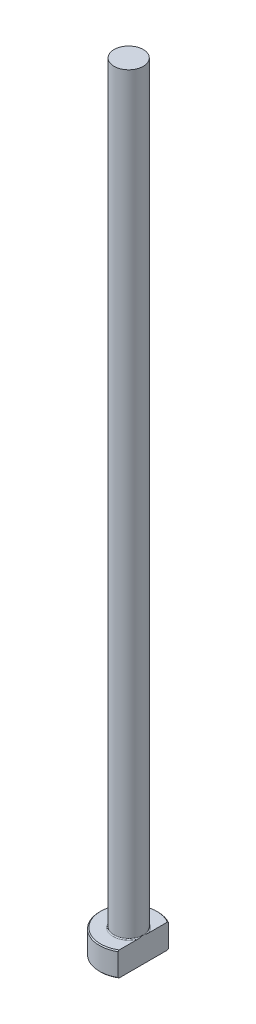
ISO-10303-21;
HEADER;
FILE_DESCRIPTION(('STEP AP214'),'2;1');
FILE_NAME('part.step','',(''),(''),'','','');
FILE_SCHEMA(('AUTOMOTIVE_DESIGN { 1 0 10303 214 1 1 1 1 }'));
ENDSEC;
DATA;
#1=APPLICATION_CONTEXT('core data for automotive mechanical design processes');
#2=APPLICATION_PROTOCOL_DEFINITION('international standard','automotive_design',2000,#1);
#3=PRODUCT_CONTEXT('',#1,'mechanical');
#4=PRODUCT('Part','Part','',(#3));
#5=PRODUCT_RELATED_PRODUCT_CATEGORY('part','',(#4));
#6=PRODUCT_DEFINITION_FORMATION('','',#4);
#7=PRODUCT_DEFINITION_CONTEXT('part definition',#1,'design');
#8=PRODUCT_DEFINITION('design','',#6,#7);
#9=PRODUCT_DEFINITION_SHAPE('','',#8);
#10=(LENGTH_UNIT() NAMED_UNIT(*) SI_UNIT(.MILLI.,.METRE.));
#11=(NAMED_UNIT(*) PLANE_ANGLE_UNIT() SI_UNIT($,.RADIAN.));
#12=(NAMED_UNIT(*) SI_UNIT($,.STERADIAN.) SOLID_ANGLE_UNIT());
#13=UNCERTAINTY_MEASURE_WITH_UNIT(LENGTH_MEASURE(1.E-05),#10,'distance_accuracy_value','');
#14=(GEOMETRIC_REPRESENTATION_CONTEXT(3) GLOBAL_UNCERTAINTY_ASSIGNED_CONTEXT((#13)) GLOBAL_UNIT_ASSIGNED_CONTEXT((#10,
#11,#12)) REPRESENTATION_CONTEXT('',''));
#15=CARTESIAN_POINT('',(0.,0.,0.));
#16=DIRECTION('',(0.,0.,1.));
#17=DIRECTION('',(1.,0.,0.));
#18=AXIS2_PLACEMENT_3D('',#15,#16,#17);
#19=CARTESIAN_POINT('',(0.,0.,0.));
#20=DIRECTION('',(0.,-1.,0.));
#21=DIRECTION('',(0.,0.,-1.));
#22=AXIS2_PLACEMENT_3D('',#19,#20,#21);
#23=PLANE('',#22);
#24=CARTESIAN_POINT('',(0.,0.,0.));
#25=DIRECTION('',(0.,-1.,0.));
#26=DIRECTION('',(0.,0.,-1.));
#27=AXIS2_PLACEMENT_3D('',#24,#25,#26);
#28=CIRCLE('',#27,5.79999999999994);
#29=CARTESIAN_POINT('',(2.99999999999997,0.,4.9638694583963));
#30=VERTEX_POINT('',#29);
#31=CARTESIAN_POINT('',(2.99999999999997,0.,-4.9638694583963));
#32=VERTEX_POINT('',#31);
#33=EDGE_CURVE('E98',#30,#32,#28,.T.);
#34=ORIENTED_EDGE('',*,*,#33,.T.);
#35=DIRECTION('',(0.,0.,1.));
#36=VECTOR('',#35,1.);
#37=CARTESIAN_POINT('',(2.99999999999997,0.,-5.19615242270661));
#38=LINE('',#37,#36);
#39=EDGE_CURVE('E83',#32,#30,#38,.T.);
#40=ORIENTED_EDGE('',*,*,#39,.T.);
#41=EDGE_LOOP('',(#34,#40));
#42=FACE_BOUND('',#41,.T.);
#43=ADVANCED_FACE('F32',(#42),#23,.T.);
#44=CARTESIAN_POINT('',(0.,259.958771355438,0.));
#45=DIRECTION('',(0.,1.,0.));
#46=DIRECTION('',(0.,0.,1.));
#47=AXIS2_PLACEMENT_3D('',#44,#45,#46);
#48=CYLINDRICAL_SURFACE('',#47,5.99999999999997);
#49=CARTESIAN_POINT('',(0.,4.80000000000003,0.));
#50=DIRECTION('',(0.,1.,0.));
#51=DIRECTION('',(0.,0.,1.));
#52=AXIS2_PLACEMENT_3D('',#49,#50,#51);
#53=CIRCLE('',#52,5.99999999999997);
#54=CARTESIAN_POINT('',(2.99999999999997,4.80000000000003,5.19615242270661));
#55=VERTEX_POINT('',#54);
#56=CARTESIAN_POINT('',(2.99999999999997,4.80000000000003,-5.19615242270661));
#57=VERTEX_POINT('',#56);
#58=EDGE_CURVE('E104',#55,#57,#53,.F.);
#59=ORIENTED_EDGE('',*,*,#58,.T.);
#60=DIRECTION('',(0.,-1.,0.));
#61=VECTOR('',#60,1.);
#62=CARTESIAN_POINT('',(2.99999999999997,160.,-5.19615242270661));
#63=LINE('',#62,#61);
#64=CARTESIAN_POINT('',(2.99999999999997,0.200000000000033,-5.19615242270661));
#65=VERTEX_POINT('',#64);
#66=EDGE_CURVE('E183',#57,#65,#63,.T.);
#67=ORIENTED_EDGE('',*,*,#66,.T.);
#68=CARTESIAN_POINT('',(0.,0.200000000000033,0.));
#69=DIRECTION('',(0.,-1.,0.));
#70=DIRECTION('',(0.,0.,-1.));
#71=AXIS2_PLACEMENT_3D('',#68,#69,#70);
#72=CIRCLE('',#71,5.99999999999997);
#73=CARTESIAN_POINT('',(2.99999999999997,0.200000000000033,5.19615242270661));
#74=VERTEX_POINT('',#73);
#75=EDGE_CURVE('E100',#65,#74,#72,.F.);
#76=ORIENTED_EDGE('',*,*,#75,.T.);
#77=DIRECTION('',(0.,-1.,0.));
#78=VECTOR('',#77,1.);
#79=CARTESIAN_POINT('',(2.99999999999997,160.,5.19615242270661));
#80=LINE('',#79,#78);
#81=EDGE_CURVE('E93',#55,#74,#80,.T.);
#82=ORIENTED_EDGE('',*,*,#81,.F.);
#83=EDGE_LOOP('',(#59,#67,#76,#82));
#84=FACE_BOUND('',#83,.T.);
#85=ADVANCED_FACE('F158',(#84),#48,.T.);
#86=CARTESIAN_POINT('',(-5.99999999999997,5.,0.));
#87=DIRECTION('',(0.,1.,0.));
#88=DIRECTION('',(0.,0.,1.));
#89=AXIS2_PLACEMENT_3D('',#86,#87,#88);
#90=PLANE('',#89);
#91=CARTESIAN_POINT('',(0.,5.,0.));
#92=DIRECTION('',(0.,1.,0.));
#93=DIRECTION('',(0.,0.,1.));
#94=AXIS2_PLACEMENT_3D('',#91,#92,#93);
#95=CIRCLE('',#94,5.79999999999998);
#96=CARTESIAN_POINT('',(2.99999999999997,5.,-4.96386945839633));
#97=VERTEX_POINT('',#96);
#98=CARTESIAN_POINT('',(2.99999999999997,5.,4.96386945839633));
#99=VERTEX_POINT('',#98);
#100=EDGE_CURVE('E178',#97,#99,#95,.T.);
#101=ORIENTED_EDGE('',*,*,#100,.T.);
#102=DIRECTION('',(0.,0.,-1.));
#103=VECTOR('',#102,1.);
#104=CARTESIAN_POINT('',(2.99999999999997,5.,0.));
#105=LINE('',#104,#103);
#106=CARTESIAN_POINT('',(2.99999999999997,4.99999999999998,1.11355287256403));
#107=VERTEX_POINT('',#106);
#108=EDGE_CURVE('E57',#99,#107,#105,.T.);
#109=ORIENTED_EDGE('',*,*,#108,.T.);
#110=CARTESIAN_POINT('',(0.,5.,0.));
#111=DIRECTION('',(0.,1.,0.));
#112=DIRECTION('',(0.,0.,1.));
#113=AXIS2_PLACEMENT_3D('',#110,#111,#112);
#114=CIRCLE('',#113,3.19999999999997);
#115=CARTESIAN_POINT('',(2.99999999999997,4.99999999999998,-1.113552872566));
#116=VERTEX_POINT('',#115);
#117=EDGE_CURVE('E107',#107,#116,#114,.F.);
#118=ORIENTED_EDGE('',*,*,#117,.T.);
#119=EDGE_CURVE('E136',#116,#97,#105,.T.);
#120=ORIENTED_EDGE('',*,*,#119,.T.);
#121=EDGE_LOOP('',(#101,#109,#118,#120));
#122=FACE_BOUND('',#121,.T.);
#123=ADVANCED_FACE('F147',(#122),#90,.T.);
#124=CARTESIAN_POINT('',(0.,5.,0.));
#125=DIRECTION('',(0.,-1.,0.));
#126=DIRECTION('',(0.,0.,-1.));
#127=AXIS2_PLACEMENT_3D('',#124,#125,#126);
#128=CONICAL_SURFACE('',#127,5.79999999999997,0.785398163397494);
#129=ORIENTED_EDGE('',*,*,#58,.F.);
#130=CARTESIAN_POINT('',(2.99999999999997,-1.01993959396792,11.432889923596));
#131=CARTESIAN_POINT('',(2.99999999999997,-0.769424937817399,11.1738796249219));
#132=CARTESIAN_POINT('',(2.99999999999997,-0.519179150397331,10.9146084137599));
#133=CARTESIAN_POINT('',(2.99999999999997,-0.0193842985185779,10.395389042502));
#134=CARTESIAN_POINT('',(2.99999999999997,0.230164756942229,10.1354408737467));
#135=CARTESIAN_POINT('',(2.99999999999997,0.728528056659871,9.61458602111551));
#136=CARTESIAN_POINT('',(2.99999999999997,0.977341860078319,9.35367891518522));
#137=CARTESIAN_POINT('',(2.99999999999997,1.47386965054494,8.83082274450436));
#138=CARTESIAN_POINT('',(2.99999999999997,1.72158364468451,8.56887368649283));
#139=CARTESIAN_POINT('',(2.99999999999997,2.21069282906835,8.04884148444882));
#140=CARTESIAN_POINT('',(2.99999999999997,2.4521159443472,7.79078462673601));
#141=CARTESIAN_POINT('',(2.99999999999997,2.93315589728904,7.27299342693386));
#142=CARTESIAN_POINT('',(2.99999999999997,3.17277274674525,7.01325909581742));
#143=CARTESIAN_POINT('',(2.99999999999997,3.64950020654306,6.49159990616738));
#144=CARTESIAN_POINT('',(2.99999999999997,3.88661134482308,6.22967553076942));
#145=CARTESIAN_POINT('',(2.99999999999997,4.35738571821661,5.70275148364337));
#146=CARTESIAN_POINT('',(2.99999999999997,4.59104909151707,5.43775193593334));
#147=CARTESIAN_POINT('',(2.99999999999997,4.96416348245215,5.00636825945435));
#148=CARTESIAN_POINT('',(2.99999999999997,5.1052013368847,4.8413584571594));
#149=CARTESIAN_POINT('',(2.99999999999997,5.38476673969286,4.50919282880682));
#150=CARTESIAN_POINT('',(2.99999999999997,5.52329404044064,4.34203679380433));
#151=CARTESIAN_POINT('',(2.99999999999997,5.79842961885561,4.0031993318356));
#152=CARTESIAN_POINT('',(2.99999999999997,5.93500216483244,3.83148875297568));
#153=CARTESIAN_POINT('',(2.99999999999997,6.20336281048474,3.4844211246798));
#154=CARTESIAN_POINT('',(2.99999999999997,6.33515205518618,3.30906496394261));
#155=CARTESIAN_POINT('',(2.99999999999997,6.5939338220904,2.9507080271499));
#156=CARTESIAN_POINT('',(2.99999999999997,6.72082315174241,2.76763161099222));
#157=CARTESIAN_POINT('',(2.99999999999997,6.90336321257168,2.48771743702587));
#158=CARTESIAN_POINT('',(2.99999999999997,6.96295431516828,2.39345390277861));
#159=CARTESIAN_POINT('',(2.99999999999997,7.07882720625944,2.20292146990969));
#160=CARTESIAN_POINT('',(2.99999999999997,7.13510937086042,2.10665280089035));
#161=CARTESIAN_POINT('',(2.99999999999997,7.24288059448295,1.91297779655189));
#162=CARTESIAN_POINT('',(2.99999999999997,7.29441986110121,1.81559978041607));
#163=CARTESIAN_POINT('',(2.99999999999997,7.39241237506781,1.61833215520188));
#164=CARTESIAN_POINT('',(2.99999999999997,7.43886469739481,1.51844209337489));
#165=CARTESIAN_POINT('',(2.99999999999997,7.56840030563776,1.21511948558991));
#166=CARTESIAN_POINT('',(2.99999999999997,7.64209011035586,1.00730397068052));
#167=CARTESIAN_POINT('',(2.99999999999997,7.72186700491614,0.695731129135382));
#168=CARTESIAN_POINT('',(2.99999999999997,7.74302901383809,0.595791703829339));
#169=CARTESIAN_POINT('',(2.99999999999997,7.77582528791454,0.394325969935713));
#170=CARTESIAN_POINT('',(2.99999999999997,7.78746040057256,0.292799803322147));
#171=CARTESIAN_POINT('',(2.99999999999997,7.80037895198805,0.0893987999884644));
#172=CARTESIAN_POINT('',(2.99999999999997,7.80169449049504,-0.0124739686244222));
#173=CARTESIAN_POINT('',(2.99999999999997,7.79396363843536,-0.215826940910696));
#174=CARTESIAN_POINT('',(2.99999999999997,7.78491639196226,-0.317307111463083));
#175=CARTESIAN_POINT('',(2.99999999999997,7.75721241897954,-0.518039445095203));
#176=CARTESIAN_POINT('',(2.99999999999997,7.73863812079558,-0.61730321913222));
#177=CARTESIAN_POINT('',(2.99999999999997,7.6930395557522,-0.813850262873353));
#178=CARTESIAN_POINT('',(2.99999999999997,7.66601427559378,-0.911133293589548));
#179=CARTESIAN_POINT('',(2.99999999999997,7.60464499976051,-1.10394843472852));
#180=CARTESIAN_POINT('',(2.99999999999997,7.57025976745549,-1.19946724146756));
#181=CARTESIAN_POINT('',(2.99999999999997,7.4955576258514,-1.38810736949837));
#182=CARTESIAN_POINT('',(2.99999999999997,7.45524192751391,-1.48122917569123));
#183=CARTESIAN_POINT('',(2.99999999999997,7.36961028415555,-1.66561491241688));
#184=CARTESIAN_POINT('',(2.99999999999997,7.32427350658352,-1.75686908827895));
#185=CARTESIAN_POINT('',(2.99999999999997,7.22966073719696,-1.93732130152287));
#186=CARTESIAN_POINT('',(2.99999999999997,7.18038388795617,-2.02651888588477));
#187=CARTESIAN_POINT('',(2.99999999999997,7.02771106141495,-2.29153460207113));
#188=CARTESIAN_POINT('',(2.99999999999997,6.91955486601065,-2.46460625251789));
#189=CARTESIAN_POINT('',(2.99999999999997,6.69440299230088,-2.80577028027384));
#190=CARTESIAN_POINT('',(2.99999999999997,6.57737415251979,-2.97384034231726));
#191=CARTESIAN_POINT('',(2.99999999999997,6.33748949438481,-3.30561771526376));
#192=CARTESIAN_POINT('',(2.99999999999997,6.21463662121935,-3.46932716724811));
#193=CARTESIAN_POINT('',(2.99999999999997,5.96308085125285,-3.79561670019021));
#194=CARTESIAN_POINT('',(2.99999999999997,5.83432224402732,-3.95815356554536));
#195=CARTESIAN_POINT('',(2.99999999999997,5.57361365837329,-4.28066737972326));
#196=CARTESIAN_POINT('',(2.99999999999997,5.44166333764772,-4.44064405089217));
#197=CARTESIAN_POINT('',(2.99999999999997,5.17568445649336,-4.75819552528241));
#198=CARTESIAN_POINT('',(2.99999999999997,5.04166171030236,-4.91577521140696));
#199=CARTESIAN_POINT('',(2.99999999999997,4.77176230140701,-5.22934053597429));
#200=CARTESIAN_POINT('',(2.99999999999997,4.63588560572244,-5.38532614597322));
#201=CARTESIAN_POINT('',(2.99999999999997,4.27256222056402,-5.79849838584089));
#202=CARTESIAN_POINT('',(2.99999999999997,4.04384014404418,-6.054562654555));
#203=CARTESIAN_POINT('',(2.99999999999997,3.58360020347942,-6.5641703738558));
#204=CARTESIAN_POINT('',(2.99999999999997,3.35208226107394,-6.81771375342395));
#205=CARTESIAN_POINT('',(2.99999999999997,2.88678846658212,-7.32315936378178));
#206=CARTESIAN_POINT('',(2.99999999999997,2.65301069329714,-7.57505982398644));
#207=CARTESIAN_POINT('',(2.99999999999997,2.18392232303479,-8.07742926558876));
#208=CARTESIAN_POINT('',(2.99999999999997,1.94861172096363,-8.32789824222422));
#209=CARTESIAN_POINT('',(2.99999999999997,1.4865158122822,-8.81743943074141));
#210=CARTESIAN_POINT('',(2.99999999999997,1.25977806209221,-9.05655656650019));
#211=CARTESIAN_POINT('',(2.99999999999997,0.805439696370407,-9.53397105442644));
#212=CARTESIAN_POINT('',(2.99999999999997,0.577839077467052,-9.77226840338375));
#213=CARTESIAN_POINT('',(2.99999999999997,0.122198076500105,-10.2479325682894));
#214=CARTESIAN_POINT('',(2.99999999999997,-0.105841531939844,-10.4853001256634));
#215=CARTESIAN_POINT('',(2.99999999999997,-0.562491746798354,-10.9594816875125));
#216=CARTESIAN_POINT('',(2.99999999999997,-0.791102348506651,-11.1962956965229));
#217=CARTESIAN_POINT('',(2.99999999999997,-1.01993959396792,-11.432889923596));
#218=B_SPLINE_CURVE_WITH_KNOTS('',3,(#130,#131,#132,#133,#134,#135,#136,#137,#138,#139,#140,
#141,#142,#143,#144,#145,#146,#147,#148,#149,#150,#151,#152,#153,#154,#155,#156,#157,#158,#159,
#160,#161,#162,#163,#164,#165,#166,#167,#168,#169,#170,#171,#172,#173,#174,#175,#176,#177,#178,
#179,#180,#181,#182,#183,#184,#185,#186,#187,#188,#189,#190,#191,#192,#193,#194,#195,#196,#197,
#198,#199,#200,#201,#202,#203,#204,#205,#206,#207,#208,#209,#210,#211,#212,#213,#214,#215,#216,
#217),.UNSPECIFIED.,.F.,.F.,(4,2,2,2,2,2,2,2,2,2,2,2,2,2,2,2,2,2,2,2,2,2,2,2,2,2,2,2,2,2,2,2,2,
2,2,2,2,2,2,2,2,2,2,4),(0.,1.08101662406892,2.16204714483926,3.24363027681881,4.32520642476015,
5.3853446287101,6.44547590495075,7.50537917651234,8.56523985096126,9.21643479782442,
9.86769362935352,10.5258323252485,11.1838124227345,11.851781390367,12.1862877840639,
12.5207560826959,12.8511332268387,13.1815703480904,13.8399161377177,14.1460077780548,
14.4520721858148,14.7571841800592,15.0623213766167,15.3648619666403,15.6674388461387,
15.9717575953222,16.2760142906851,16.5815843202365,16.8872210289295,17.4990577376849,
18.1133060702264,18.7272470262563,19.3492675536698,19.9713550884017,20.5919343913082,
21.2125247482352,22.2425132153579,23.2725306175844,24.3035181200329,25.3345090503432,
26.3230827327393,27.3116602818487,28.299135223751,29.286602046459),.UNSPECIFIED.);
#219=EDGE_CURVE('E135',#55,#99,#218,.T.);
#220=ORIENTED_EDGE('',*,*,#219,.T.);
#221=ORIENTED_EDGE('',*,*,#100,.F.);
#222=EDGE_CURVE('E127',#97,#57,#218,.T.);
#223=ORIENTED_EDGE('',*,*,#222,.T.);
#224=EDGE_LOOP('',(#129,#220,#221,#223));
#225=FACE_BOUND('',#224,.T.);
#226=ADVANCED_FACE('F143',(#225),#128,.T.);
#227=CARTESIAN_POINT('',(0.,0.200000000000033,0.));
#228=DIRECTION('',(0.,1.,0.));
#229=DIRECTION('',(0.,0.,1.));
#230=AXIS2_PLACEMENT_3D('',#227,#228,#229);
#231=CONICAL_SURFACE('',#230,5.99999999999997,0.785398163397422);
#232=ORIENTED_EDGE('',*,*,#75,.F.);
#233=CARTESIAN_POINT('',(2.99999999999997,6.01993959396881,-11.432889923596));
#234=CARTESIAN_POINT('',(2.99999999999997,5.76942493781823,-11.1738796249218));
#235=CARTESIAN_POINT('',(2.99999999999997,5.5191791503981,-10.9146084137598));
#236=CARTESIAN_POINT('',(2.99999999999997,5.01938429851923,-10.3953890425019));
#237=CARTESIAN_POINT('',(2.99999999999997,4.76983524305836,-10.1354408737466));
#238=CARTESIAN_POINT('',(2.99999999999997,4.27147194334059,-9.61458602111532));
#239=CARTESIAN_POINT('',(2.99999999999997,4.02265813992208,-9.35367891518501));
#240=CARTESIAN_POINT('',(2.99999999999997,3.52613034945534,-8.83082274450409));
#241=CARTESIAN_POINT('',(2.99999999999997,3.27841635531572,-8.56887368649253));
#242=CARTESIAN_POINT('',(2.99999999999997,2.78930717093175,-8.04884148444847));
#243=CARTESIAN_POINT('',(2.99999999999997,2.54788405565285,-7.79078462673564));
#244=CARTESIAN_POINT('',(2.99999999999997,2.0668441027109,-7.27299342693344));
#245=CARTESIAN_POINT('',(2.99999999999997,1.82722725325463,-7.01325909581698));
#246=CARTESIAN_POINT('',(2.99999999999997,1.35049979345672,-6.49159990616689));
#247=CARTESIAN_POINT('',(2.99999999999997,1.11338865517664,-6.2296755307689));
#248=CARTESIAN_POINT('',(2.99999999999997,0.642614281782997,-5.70275148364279));
#249=CARTESIAN_POINT('',(2.99999999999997,0.408950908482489,-5.43775193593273));
#250=CARTESIAN_POINT('',(2.99999999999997,0.0358365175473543,-5.00636825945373));
#251=CARTESIAN_POINT('',(2.99999999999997,-0.105201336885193,-4.8413584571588));
#252=CARTESIAN_POINT('',(2.99999999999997,-0.384766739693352,-4.50919282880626));
#253=CARTESIAN_POINT('',(2.99999999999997,-0.523294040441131,-4.34203679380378));
#254=CARTESIAN_POINT('',(2.99999999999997,-0.7984296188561,-4.00319933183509));
#255=CARTESIAN_POINT('',(2.99999999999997,-0.935002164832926,-3.83148875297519));
#256=CARTESIAN_POINT('',(2.99999999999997,-1.20336281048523,-3.48442112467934));
#257=CARTESIAN_POINT('',(2.99999999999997,-1.33515205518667,-3.30906496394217));
#258=CARTESIAN_POINT('',(2.99999999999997,-1.59393382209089,-2.95070802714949));
#259=CARTESIAN_POINT('',(2.99999999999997,-1.7208231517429,-2.76763161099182));
#260=CARTESIAN_POINT('',(2.99999999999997,-1.90336321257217,-2.48771743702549));
#261=CARTESIAN_POINT('',(2.99999999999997,-1.96295431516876,-2.39345390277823));
#262=CARTESIAN_POINT('',(2.99999999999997,-2.07882720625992,-2.20292146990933));
#263=CARTESIAN_POINT('',(2.99999999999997,-2.1351093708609,-2.10665280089));
#264=CARTESIAN_POINT('',(2.99999999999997,-2.24288059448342,-1.91297779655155));
#265=CARTESIAN_POINT('',(2.99999999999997,-2.29441986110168,-1.81559978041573));
#266=CARTESIAN_POINT('',(2.99999999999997,-2.39241237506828,-1.61833215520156));
#267=CARTESIAN_POINT('',(2.99999999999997,-2.43886469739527,-1.51844209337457));
#268=CARTESIAN_POINT('',(2.99999999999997,-2.56840030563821,-1.2151194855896));
#269=CARTESIAN_POINT('',(2.99999999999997,-2.6420901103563,-1.00730397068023));
#270=CARTESIAN_POINT('',(2.99999999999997,-2.72186700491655,-0.69573112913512));
#271=CARTESIAN_POINT('',(2.99999999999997,-2.7430290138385,-0.595791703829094));
#272=CARTESIAN_POINT('',(2.99999999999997,-2.77582528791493,-0.394325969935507));
#273=CARTESIAN_POINT('',(2.99999999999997,-2.78746040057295,-0.292799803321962));
#274=CARTESIAN_POINT('',(2.99999999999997,-2.80037895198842,-0.0893987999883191));
#275=CARTESIAN_POINT('',(2.99999999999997,-2.8016944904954,0.0124739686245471));
#276=CARTESIAN_POINT('',(2.99999999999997,-2.79396363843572,0.215826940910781));
#277=CARTESIAN_POINT('',(2.99999999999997,-2.78491639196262,0.317307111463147));
#278=CARTESIAN_POINT('',(2.99999999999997,-2.7572124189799,0.518039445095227));
#279=CARTESIAN_POINT('',(2.99999999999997,-2.73863812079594,0.617303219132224));
#280=CARTESIAN_POINT('',(2.99999999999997,-2.69303955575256,0.813850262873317));
#281=CARTESIAN_POINT('',(2.99999999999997,-2.66601427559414,0.911133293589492));
#282=CARTESIAN_POINT('',(2.99999999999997,-2.60464499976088,1.10394843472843));
#283=CARTESIAN_POINT('',(2.99999999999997,-2.57025976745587,1.19946724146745));
#284=CARTESIAN_POINT('',(2.99999999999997,-2.49555762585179,1.38810736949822));
#285=CARTESIAN_POINT('',(2.99999999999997,-2.4552419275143,1.48122917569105));
#286=CARTESIAN_POINT('',(2.99999999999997,-2.36961028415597,1.66561491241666));
#287=CARTESIAN_POINT('',(2.99999999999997,-2.32427350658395,1.7568690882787));
#288=CARTESIAN_POINT('',(2.99999999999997,-2.22966073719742,1.93732130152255));
#289=CARTESIAN_POINT('',(2.99999999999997,-2.18038388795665,2.02651888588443));
#290=CARTESIAN_POINT('',(2.99999999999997,-2.02771106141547,2.2915346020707));
#291=CARTESIAN_POINT('',(2.99999999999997,-1.91955486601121,2.4646062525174));
#292=CARTESIAN_POINT('',(2.99999999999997,-1.6944029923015,2.80577028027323));
#293=CARTESIAN_POINT('',(2.99999999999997,-1.57737415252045,2.9738403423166));
#294=CARTESIAN_POINT('',(2.99999999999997,-1.33748949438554,3.30561771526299));
#295=CARTESIAN_POINT('',(2.99999999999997,-1.21463662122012,3.46932716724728));
#296=CARTESIAN_POINT('',(2.99999999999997,-0.96308085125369,3.79561670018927));
#297=CARTESIAN_POINT('',(2.99999999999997,-0.834322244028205,3.95815356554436));
#298=CARTESIAN_POINT('',(2.99999999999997,-0.573613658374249,4.28066737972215));
#299=CARTESIAN_POINT('',(2.99999999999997,-0.441663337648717,4.440644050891));
#300=CARTESIAN_POINT('',(2.99999999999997,-0.175684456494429,4.75819552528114));
#301=CARTESIAN_POINT('',(2.99999999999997,-0.0416617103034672,4.91577521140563));
#302=CARTESIAN_POINT('',(2.99999999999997,0.228237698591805,5.22934053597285));
#303=CARTESIAN_POINT('',(2.99999999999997,0.364114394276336,5.38532614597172));
#304=CARTESIAN_POINT('',(2.99999999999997,0.727437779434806,5.79849838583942));
#305=CARTESIAN_POINT('',(2.99999999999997,0.956159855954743,6.05456265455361));
#306=CARTESIAN_POINT('',(2.99999999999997,1.41639979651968,6.56417037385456));
#307=CARTESIAN_POINT('',(2.99999999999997,1.64791773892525,6.81771375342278));
#308=CARTESIAN_POINT('',(2.99999999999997,2.11321153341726,7.32315936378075));
#309=CARTESIAN_POINT('',(2.99999999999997,2.34698930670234,7.57505982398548));
#310=CARTESIAN_POINT('',(2.99999999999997,2.81607767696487,8.07742926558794));
#311=CARTESIAN_POINT('',(2.99999999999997,3.05138827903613,8.32789824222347));
#312=CARTESIAN_POINT('',(2.99999999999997,3.51348418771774,8.81743943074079));
#313=CARTESIAN_POINT('',(2.99999999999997,3.74022193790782,9.05655656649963));
#314=CARTESIAN_POINT('',(2.99999999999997,4.1945603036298,9.53397105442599));
#315=CARTESIAN_POINT('',(2.99999999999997,4.42216092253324,9.77226840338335));
#316=CARTESIAN_POINT('',(2.99999999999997,4.87780192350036,10.2479325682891));
#317=CARTESIAN_POINT('',(2.99999999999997,5.10584153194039,10.4853001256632));
#318=CARTESIAN_POINT('',(2.99999999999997,5.56249174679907,10.9594816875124));
#319=CARTESIAN_POINT('',(2.99999999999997,5.79110234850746,11.1962956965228));
#320=CARTESIAN_POINT('',(2.99999999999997,6.01993959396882,11.432889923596));
#321=B_SPLINE_CURVE_WITH_KNOTS('',3,(#233,#234,#235,#236,#237,#238,#239,#240,#241,#242,#243,
#244,#245,#246,#247,#248,#249,#250,#251,#252,#253,#254,#255,#256,#257,#258,#259,#260,#261,#262,
#263,#264,#265,#266,#267,#268,#269,#270,#271,#272,#273,#274,#275,#276,#277,#278,#279,#280,#281,
#282,#283,#284,#285,#286,#287,#288,#289,#290,#291,#292,#293,#294,#295,#296,#297,#298,#299,#300,
#301,#302,#303,#304,#305,#306,#307,#308,#309,#310,#311,#312,#313,#314,#315,#316,#317,#318,#319,
#320),.UNSPECIFIED.,.F.,.F.,(4,2,2,2,2,2,2,2,2,2,2,2,2,2,2,2,2,2,2,2,2,2,2,2,2,2,2,2,2,2,2,2,2,
2,2,2,2,2,2,2,2,2,2,4),(0.,1.08101662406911,2.16204714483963,3.24363027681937,4.32520642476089,
5.38534462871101,6.44547590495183,7.50537917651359,8.56523985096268,9.21643479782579,
9.86769362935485,10.5258323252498,11.1838124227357,11.8517813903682,12.1862877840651,
12.5207560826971,12.8511332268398,13.1815703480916,13.8399161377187,14.1460077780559,
14.4520721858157,14.7571841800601,15.0623213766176,15.3648619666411,15.6674388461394,
15.9717575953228,16.2760142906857,16.581584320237,16.8872210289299,17.4990577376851,
18.1133060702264,18.7272470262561,19.3492675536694,19.9713550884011,20.5919343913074,
21.2125247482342,22.2425132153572,23.2725306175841,24.3035181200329,25.3345090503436,
26.32308273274,27.3116602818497,28.2991352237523,29.2866020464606),.UNSPECIFIED.);
#322=EDGE_CURVE('E86',#65,#32,#321,.T.);
#323=ORIENTED_EDGE('',*,*,#322,.T.);
#324=ORIENTED_EDGE('',*,*,#33,.F.);
#325=EDGE_CURVE('E89',#30,#74,#321,.T.);
#326=ORIENTED_EDGE('',*,*,#325,.T.);
#327=EDGE_LOOP('',(#232,#323,#324,#326));
#328=FACE_BOUND('',#327,.T.);
#329=ADVANCED_FACE('F97',(#328),#231,.T.);
#330=CARTESIAN_POINT('',(0.,5.19999999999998,0.));
#331=DIRECTION('',(0.,1.,0.));
#332=DIRECTION('',(0.,0.,1.));
#333=AXIS2_PLACEMENT_3D('',#330,#331,#332);
#334=TOROIDAL_SURFACE('',#333,3.19999999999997,0.2);
#335=CARTESIAN_POINT('',(2.99999999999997,5.19999999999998,0.));
#336=CARTESIAN_POINT('',(2.99999999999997,5.20000054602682,-8.25589702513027E-09));
#337=CARTESIAN_POINT('',(2.99999999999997,5.20000108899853,-2.22623702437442E-07));
#338=CARTESIAN_POINT('',(2.99999999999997,5.20000210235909,-8.13181300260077E-07));
#339=CARTESIAN_POINT('',(2.99999999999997,5.20000256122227,-1.20262206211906E-06));
#340=CARTESIAN_POINT('',(2.99999999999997,5.20000351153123,-2.13233189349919E-06));
#341=CARTESIAN_POINT('',(2.99999999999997,5.2000039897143,-2.68711073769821E-06));
#342=CARTESIAN_POINT('',(2.99999999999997,5.20000484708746,-3.83722986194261E-06));
#343=CARTESIAN_POINT('',(2.99999999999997,5.20000522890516,-4.43075968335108E-06));
#344=CARTESIAN_POINT('',(2.99999999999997,5.20000663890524,-6.71805399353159E-06));
#345=CARTESIAN_POINT('',(2.99999999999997,5.20000758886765,-8.46267320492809E-06));
#346=CARTESIAN_POINT('',(2.99999999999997,5.20000915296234,-1.19195937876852E-05));
#347=CARTESIAN_POINT('',(2.99999999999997,5.20000978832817,-1.36226966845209E-05));
#348=CARTESIAN_POINT('',(2.99999999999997,5.20001243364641,-2.07785327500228E-05));
#349=CARTESIAN_POINT('',(2.99999999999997,5.20001439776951,-2.62512686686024E-05));
#350=CARTESIAN_POINT('',(2.99999999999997,5.20001730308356,-3.65971251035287E-05));
#351=CARTESIAN_POINT('',(2.99999999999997,5.20001835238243,-4.14397201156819E-05));
#352=CARTESIAN_POINT('',(2.99999999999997,5.20002589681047,-7.68826107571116E-05));
#353=CARTESIAN_POINT('',(2.99999999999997,5.20003169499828,-0.000107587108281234));
#354=CARTESIAN_POINT('',(2.99999999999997,5.20005649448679,-0.000225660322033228));
#355=CARTESIAN_POINT('',(2.99999999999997,5.2000799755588,-0.000312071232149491));
#356=CARTESIAN_POINT('',(2.99999999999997,5.2001671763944,-0.000638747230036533));
#357=CARTESIAN_POINT('',(2.99999999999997,5.20022823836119,-0.000879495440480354));
#358=CARTESIAN_POINT('',(2.99999999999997,5.20046253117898,-0.00179757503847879));
#359=CARTESIAN_POINT('',(2.99999999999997,5.20063826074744,-0.00247448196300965));
#360=CARTESIAN_POINT('',(2.99999999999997,5.20145771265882,-0.00563611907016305));
#361=CARTESIAN_POINT('',(2.99999999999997,5.20209802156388,-0.00812138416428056));
#362=CARTESIAN_POINT('',(2.99999999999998,5.207470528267,-0.0289666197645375));
#363=CARTESIAN_POINT('',(2.99999999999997,5.2122144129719,-0.0473249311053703));
#364=CARTESIAN_POINT('',(2.99999999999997,5.2215041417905,-0.0833908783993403));
#365=CARTESIAN_POINT('',(2.99999999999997,5.22605099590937,-0.101098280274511));
#366=CARTESIAN_POINT('',(2.99999999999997,5.24071513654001,-0.158441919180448));
#367=CARTESIAN_POINT('',(2.99999999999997,5.25076238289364,-0.198096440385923));
#368=CARTESIAN_POINT('',(2.99999999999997,5.26735876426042,-0.264903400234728));
#369=CARTESIAN_POINT('',(2.99999999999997,5.27400650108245,-0.292031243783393));
#370=CARTESIAN_POINT('',(2.99999999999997,5.28691139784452,-0.345693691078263));
#371=CARTESIAN_POINT('',(2.99999999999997,5.29317409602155,-0.372226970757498));
#372=CARTESIAN_POINT('',(2.99999999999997,5.31359314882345,-0.460847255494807));
#373=CARTESIAN_POINT('',(2.99999999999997,5.3271194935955,-0.52308420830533));
#374=CARTESIAN_POINT('',(2.99999999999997,5.35185224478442,-0.648627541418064));
#375=CARTESIAN_POINT('',(2.99999999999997,5.36303576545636,-0.711938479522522));
#376=CARTESIAN_POINT('',(2.99999999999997,5.382697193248,-0.845442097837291));
#377=CARTESIAN_POINT('',(2.99999999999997,5.39079783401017,-0.915695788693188));
#378=CARTESIAN_POINT('',(2.99999999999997,5.39788104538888,-1.02128246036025));
#379=CARTESIAN_POINT('',(2.99999999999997,5.399399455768,-1.05644278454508));
#380=CARTESIAN_POINT('',(2.99999999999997,5.40031405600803,-1.12678521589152));
#381=CARTESIAN_POINT('',(2.99999999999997,5.39971158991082,-1.16196729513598));
#382=CARTESIAN_POINT('',(2.99999999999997,5.39660553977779,-1.21713951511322));
#383=CARTESIAN_POINT('',(2.99999999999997,5.39502683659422,-1.23718181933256));
#384=CARTESIAN_POINT('',(2.99999999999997,5.39080008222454,-1.27717351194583));
#385=CARTESIAN_POINT('',(2.99999999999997,5.38815120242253,-1.29712281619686));
#386=CARTESIAN_POINT('',(2.99999999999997,5.38160570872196,-1.33655702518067));
#387=CARTESIAN_POINT('',(2.99999999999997,5.37772556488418,-1.35604460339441));
#388=CARTESIAN_POINT('',(2.99999999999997,5.36841119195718,-1.39463554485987));
#389=CARTESIAN_POINT('',(2.99999999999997,5.36297874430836,-1.41373932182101));
#390=CARTESIAN_POINT('',(2.99999999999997,5.3500393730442,-1.45151809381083));
#391=CARTESIAN_POINT('',(2.99999999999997,5.34250654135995,-1.47018435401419));
#392=CARTESIAN_POINT('',(2.99999999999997,5.32469433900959,-1.50617232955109));
#393=CARTESIAN_POINT('',(2.99999999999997,5.31442814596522,-1.52349999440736));
#394=CARTESIAN_POINT('',(2.99999999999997,5.29768486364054,-1.5453003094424));
#395=CARTESIAN_POINT('',(2.99999999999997,5.29285641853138,-1.551032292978));
#396=CARTESIAN_POINT('',(2.99999999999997,5.28257691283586,-1.56192749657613));
#397=CARTESIAN_POINT('',(2.99999999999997,5.27712536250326,-1.56709026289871));
#398=CARTESIAN_POINT('',(2.99999999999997,5.26548354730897,-1.57666725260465));
#399=CARTESIAN_POINT('',(2.99999999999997,5.25928560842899,-1.58107232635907));
#400=CARTESIAN_POINT('',(2.99999999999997,5.24620912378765,-1.5887219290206));
#401=CARTESIAN_POINT('',(2.99999999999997,5.23933242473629,-1.59196950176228));
#402=CARTESIAN_POINT('',(2.99999999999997,5.22702406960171,-1.5962468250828));
#403=CARTESIAN_POINT('',(2.99999999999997,5.2217197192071,-1.59764171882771));
#404=CARTESIAN_POINT('',(2.99999999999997,5.2109516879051,-1.59951721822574));
#405=CARTESIAN_POINT('',(2.99999999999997,5.20548813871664,-1.59999855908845));
#406=CARTESIAN_POINT('',(2.99999999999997,5.19455397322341,-1.60000143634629));
#407=CARTESIAN_POINT('',(2.99999999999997,5.18908335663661,-1.59952177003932));
#408=CARTESIAN_POINT('',(2.99999999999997,5.17830149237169,-1.59764696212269));
#409=CARTESIAN_POINT('',(2.99999999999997,5.17299036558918,-1.59625114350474));
#410=CARTESIAN_POINT('',(2.99999999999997,5.16137413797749,-1.5922159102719));
#411=CARTESIAN_POINT('',(2.99999999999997,5.15514663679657,-1.58935479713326));
#412=CARTESIAN_POINT('',(2.99999999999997,5.14323789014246,-1.58266473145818));
#413=CARTESIAN_POINT('',(2.99999999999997,5.13755768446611,-1.57883398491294));
#414=CARTESIAN_POINT('',(2.99999999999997,5.12388989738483,-1.5682309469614));
#415=CARTESIAN_POINT('',(2.99999999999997,5.11627920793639,-1.56097697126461));
#416=CARTESIAN_POINT('',(2.99999999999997,5.10222993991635,-1.54541986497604));
#417=CARTESIAN_POINT('',(2.99999999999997,5.09579438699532,-1.53711411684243));
#418=CARTESIAN_POINT('',(2.99999999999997,5.07874447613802,-1.51234359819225));
#419=CARTESIAN_POINT('',(2.99999999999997,5.06934681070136,-1.49505024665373));
#420=CARTESIAN_POINT('',(2.99999999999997,5.05300413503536,-1.45936637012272));
#421=CARTESIAN_POINT('',(2.99999999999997,5.04606563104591,-1.440973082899));
#422=CARTESIAN_POINT('',(2.99999999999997,5.03343712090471,-1.40170303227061));
#423=CARTESIAN_POINT('',(2.99999999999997,5.02794514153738,-1.38076360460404));
#424=CARTESIAN_POINT('',(2.99999999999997,5.01869119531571,-1.33849708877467));
#425=CARTESIAN_POINT('',(2.99999999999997,5.01493126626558,-1.31716957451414));
#426=CARTESIAN_POINT('',(2.99999999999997,5.00879575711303,-1.27427301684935));
#427=CARTESIAN_POINT('',(2.99999999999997,5.00642327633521,-1.25270354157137));
#428=CARTESIAN_POINT('',(2.99999999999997,5.00283272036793,-1.20948719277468));
#429=CARTESIAN_POINT('',(2.99999999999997,5.00161392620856,-1.18784037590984));
#430=CARTESIAN_POINT('',(2.99999999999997,4.99921193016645,-1.11739576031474));
#431=CARTESIAN_POINT('',(2.99999999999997,4.99998309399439,-1.06853061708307));
#432=CARTESIAN_POINT('',(2.99999999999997,5.00498456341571,-0.970964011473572));
#433=CARTESIAN_POINT('',(2.99999999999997,5.00921876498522,-0.922262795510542));
#434=CARTESIAN_POINT('',(2.99999999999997,5.02027934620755,-0.825023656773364));
#435=CARTESIAN_POINT('',(2.99999999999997,5.02711306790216,-0.776486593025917));
#436=CARTESIAN_POINT('',(2.99999999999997,5.04272509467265,-0.679720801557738));
#437=CARTESIAN_POINT('',(2.99999999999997,5.05150395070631,-0.631492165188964));
#438=CARTESIAN_POINT('',(2.99999999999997,5.07999589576,-0.487173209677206));
#439=CARTESIAN_POINT('',(2.99999999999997,5.10185558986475,-0.391514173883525));
#440=CARTESIAN_POINT('',(2.99999999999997,5.14819769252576,-0.200831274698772));
#441=CARTESIAN_POINT('',(2.99999999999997,5.17268119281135,-0.105807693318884));
#442=CARTESIAN_POINT('',(2.99999999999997,5.19722910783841,-0.0107318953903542));
#443=CARTESIAN_POINT('',(2.99999999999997,5.19724528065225,-0.0106692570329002));
#444=CARTESIAN_POINT('',(2.99999999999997,5.19781243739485,-0.00847232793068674));
#445=CARTESIAN_POINT('',(2.99999999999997,5.19836102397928,-0.00633759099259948));
#446=CARTESIAN_POINT('',(2.99999999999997,5.1991597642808,-0.00325873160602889));
#447=CARTESIAN_POINT('',(2.99999999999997,5.19940591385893,-0.00231386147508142));
#448=CARTESIAN_POINT('',(2.99999999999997,5.19972567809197,-0.00105818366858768));
#449=CARTESIAN_POINT('',(2.99999999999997,5.19980400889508,-0.000748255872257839));
#450=CARTESIAN_POINT('',(2.99999999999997,5.1999122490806,-0.000340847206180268));
#451=CARTESIAN_POINT('',(2.99999999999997,5.19993871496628,-0.000242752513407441));
#452=CARTESIAN_POINT('',(2.99999999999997,5.19996623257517,-0.000111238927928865));
#453=CARTESIAN_POINT('',(2.99999999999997,5.19997237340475,-7.89037769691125E-05));
#454=CARTESIAN_POINT('',(2.99999999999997,5.19998062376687,-4.17973012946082E-05));
#455=CARTESIAN_POINT('',(2.99999999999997,5.19998174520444,-3.68646325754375E-05));
#456=CARTESIAN_POINT('',(2.99999999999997,5.19998486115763,-2.6333709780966E-05));
#457=CARTESIAN_POINT('',(2.99999999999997,5.19998697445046,-2.0770778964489E-05));
#458=CARTESIAN_POINT('',(2.99999999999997,5.19998981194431,-1.35213137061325E-05));
#459=CARTESIAN_POINT('',(2.99999999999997,5.19999048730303,-1.18115060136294E-05));
#460=CARTESIAN_POINT('',(2.99999999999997,5.19999214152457,-8.34771962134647E-06));
#461=CARTESIAN_POINT('',(2.99999999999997,5.19999314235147,-6.60378870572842E-06));
#462=CARTESIAN_POINT('',(2.99999999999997,5.1999946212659,-4.32501646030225E-06));
#463=CARTESIAN_POINT('',(2.99999999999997,5.1999950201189,-3.73587510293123E-06));
#464=CARTESIAN_POINT('',(2.99999999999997,5.19999591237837,-2.59760768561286E-06));
#465=CARTESIAN_POINT('',(2.99999999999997,5.19999640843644,-2.05040430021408E-06));
#466=CARTESIAN_POINT('',(2.99999999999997,5.19999738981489,-1.1384674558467E-06));
#467=CARTESIAN_POINT('',(2.99999999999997,5.19999786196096,-7.58552551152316E-07));
#468=CARTESIAN_POINT('',(2.99999999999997,5.19999889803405,-1.92079005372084E-07));
#469=CARTESIAN_POINT('',(2.99999999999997,5.19999945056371,8.30744745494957E-09));
#470=CARTESIAN_POINT('',(2.99999999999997,5.19999999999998,0.));
#471=B_SPLINE_CURVE_WITH_KNOTS('',3,(#335,#336,#337,#338,#339,#340,#341,#342,#343,#344,#345,
#346,#347,#348,#349,#350,#351,#352,#353,#354,#355,#356,#357,#358,#359,#360,#361,#362,#363,#364,
#365,#366,#367,#368,#369,#370,#371,#372,#373,#374,#375,#376,#377,#378,#379,#380,#381,#382,#383,
#384,#385,#386,#387,#388,#389,#390,#391,#392,#393,#394,#395,#396,#397,#398,#399,#400,#401,#402,
#403,#404,#405,#406,#407,#408,#409,#410,#411,#412,#413,#414,#415,#416,#417,#418,#419,#420,#421,
#422,#423,#424,#425,#426,#427,#428,#429,#430,#431,#432,#433,#434,#435,#436,#437,#438,#439,#440,
#441,#442,#443,#444,#445,#446,#447,#448,#449,#450,#451,#452,#453,#454,#455,#456,#457,#458,#459,
#460,#461,#462,#463,#464,#465,#466,#467,#468,#469,#470),.UNSPECIFIED.,.T.,.F.,(4,2,2,2,2,2,2,2,
2,2,2,2,2,2,2,2,2,2,2,2,2,2,2,2,2,2,2,2,2,2,2,2,2,2,2,2,2,2,2,2,2,2,2,2,2,2,2,2,2,2,2,2,2,2,2,2,
2,2,2,2,2,2,2,2,2,2,2,4),(0.,1.65204701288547E-06,3.45848810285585E-06,5.64280272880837E-06,
7.75882449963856E-06,1.36969712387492E-05,1.9145444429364E-05,3.65603925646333E-05,
5.14083087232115E-05,0.000145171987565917,0.000413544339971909,0.00115890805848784,
0.00325667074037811,0.0109563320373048,0.067838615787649,0.122684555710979,0.245405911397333,
0.329196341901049,0.410983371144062,0.602016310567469,0.79483628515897,1.00673763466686,
1.11227258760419,1.21774067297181,1.27803175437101,1.33836960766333,1.39793215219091,
1.45742661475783,1.51769013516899,1.57766822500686,1.60011625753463,1.62258205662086,
1.64530254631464,1.66796284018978,1.68434680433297,1.70071757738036,1.71710885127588,
1.7335122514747,1.75395806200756,1.77444198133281,1.8058056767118,1.83724902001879,
1.89596356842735,1.95483231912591,2.01967230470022,2.08458838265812,2.14964892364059,
2.21466889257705,2.3610799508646,2.50765595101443,2.65464904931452,2.80168383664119,
3.09594779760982,3.39033467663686,3.39052875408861,3.3971415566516,3.40007033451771,
3.40102967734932,3.4013342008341,3.40143296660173,3.40144812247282,3.40146594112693,
3.40147145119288,3.401477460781,3.40147959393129,3.40148179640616,3.40148361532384,
3.40148527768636),.UNSPECIFIED.);
#472=CARTESIAN_POINT('',(2.99999999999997,5.19999999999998,0.));
#473=VERTEX_POINT('',#472);
#474=EDGE_CURVE('E11',#116,#473,#471,.T.);
#475=ORIENTED_EDGE('',*,*,#474,.F.);
#476=ORIENTED_EDGE('',*,*,#117,.F.);
#477=CARTESIAN_POINT('',(2.99999999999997,5.19999999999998,0.));
#478=CARTESIAN_POINT('',(2.99999999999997,5.19999945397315,8.25589702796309E-09));
#479=CARTESIAN_POINT('',(2.99999999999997,5.19999891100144,2.22623702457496E-07));
#480=CARTESIAN_POINT('',(2.99999999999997,5.19999789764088,8.13181300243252E-07));
#481=CARTESIAN_POINT('',(2.99999999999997,5.19999743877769,1.20262206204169E-06));
#482=CARTESIAN_POINT('',(2.99999999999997,5.19999648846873,2.13233189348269E-06));
#483=CARTESIAN_POINT('',(2.99999999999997,5.19999601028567,2.68711073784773E-06));
#484=CARTESIAN_POINT('',(2.99999999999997,5.19999515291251,3.83722986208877E-06));
#485=CARTESIAN_POINT('',(2.99999999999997,5.1999947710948,4.43075968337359E-06));
#486=CARTESIAN_POINT('',(2.99999999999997,5.19999336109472,6.71805399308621E-06));
#487=CARTESIAN_POINT('',(2.99999999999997,5.19999241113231,8.46267320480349E-06));
#488=CARTESIAN_POINT('',(2.99999999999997,5.19999084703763,1.19195937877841E-05));
#489=CARTESIAN_POINT('',(2.99999999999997,5.1999902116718,1.36226966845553E-05));
#490=CARTESIAN_POINT('',(2.99999999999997,5.19998756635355,2.07785327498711E-05));
#491=CARTESIAN_POINT('',(2.99999999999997,5.19998560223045,2.62512686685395E-05));
#492=CARTESIAN_POINT('',(2.99999999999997,5.1999826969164,3.65971251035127E-05));
#493=CARTESIAN_POINT('',(2.99999999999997,5.19998164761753,4.14397201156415E-05));
#494=CARTESIAN_POINT('',(2.99999999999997,5.19997410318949,7.68826107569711E-05));
#495=CARTESIAN_POINT('',(2.99999999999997,5.19996830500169,0.000107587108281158));
#496=CARTESIAN_POINT('',(2.99999999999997,5.19994350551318,0.000225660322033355));
#497=CARTESIAN_POINT('',(2.99999999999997,5.19992002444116,0.000312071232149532));
#498=CARTESIAN_POINT('',(2.99999999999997,5.19983282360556,0.000638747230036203));
#499=CARTESIAN_POINT('',(2.99999999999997,5.19977176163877,0.000879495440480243));
#500=CARTESIAN_POINT('',(2.99999999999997,5.19953746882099,0.00179757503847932));
#501=CARTESIAN_POINT('',(2.99999999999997,5.19936173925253,0.00247448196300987));
#502=CARTESIAN_POINT('',(2.99999999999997,5.19854228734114,0.00563611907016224));
#503=CARTESIAN_POINT('',(2.99999999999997,5.19790197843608,0.0081213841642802));
#504=CARTESIAN_POINT('',(2.99999999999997,5.19252947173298,0.0289666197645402));
#505=CARTESIAN_POINT('',(2.99999999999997,5.18778558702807,0.0473249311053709));
#506=CARTESIAN_POINT('',(2.99999999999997,5.17849585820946,0.0833908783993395));
#507=CARTESIAN_POINT('',(2.99999999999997,5.17394900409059,0.101098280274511));
#508=CARTESIAN_POINT('',(2.99999999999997,5.15928486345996,0.158441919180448));
#509=CARTESIAN_POINT('',(2.99999999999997,5.14923761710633,0.198096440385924));
#510=CARTESIAN_POINT('',(2.99999999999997,5.13264123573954,0.264903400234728));
#511=CARTESIAN_POINT('',(2.99999999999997,5.12599349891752,0.292031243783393));
#512=CARTESIAN_POINT('',(2.99999999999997,5.11308860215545,0.345693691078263));
#513=CARTESIAN_POINT('',(2.99999999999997,5.10682590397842,0.372226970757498));
#514=CARTESIAN_POINT('',(2.99999999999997,5.08640685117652,0.460847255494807));
#515=CARTESIAN_POINT('',(2.99999999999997,5.07288050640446,0.52308420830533));
#516=CARTESIAN_POINT('',(2.99999999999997,5.04814775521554,0.648627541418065));
#517=CARTESIAN_POINT('',(2.99999999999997,5.0369642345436,0.711938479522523));
#518=CARTESIAN_POINT('',(2.99999999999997,5.01730280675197,0.845442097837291));
#519=CARTESIAN_POINT('',(2.99999999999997,5.0092021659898,0.915695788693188));
#520=CARTESIAN_POINT('',(2.99999999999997,5.00211895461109,1.02128246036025));
#521=CARTESIAN_POINT('',(2.99999999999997,5.00060054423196,1.05644278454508));
#522=CARTESIAN_POINT('',(2.99999999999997,4.99968594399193,1.12678521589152));
#523=CARTESIAN_POINT('',(2.99999999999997,5.00028841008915,1.16196729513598));
#524=CARTESIAN_POINT('',(2.99999999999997,5.00339446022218,1.21713951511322));
#525=CARTESIAN_POINT('',(2.99999999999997,5.00497316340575,1.23718181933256));
#526=CARTESIAN_POINT('',(2.99999999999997,5.00919991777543,1.27717351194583));
#527=CARTESIAN_POINT('',(2.99999999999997,5.01184879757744,1.29712281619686));
#528=CARTESIAN_POINT('',(2.99999999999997,5.01839429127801,1.33655702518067));
#529=CARTESIAN_POINT('',(2.99999999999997,5.02227443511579,1.35604460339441));
#530=CARTESIAN_POINT('',(2.99999999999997,5.03158880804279,1.39463554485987));
#531=CARTESIAN_POINT('',(2.99999999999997,5.0370212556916,1.41373932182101));
#532=CARTESIAN_POINT('',(2.99999999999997,5.04996062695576,1.45151809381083));
#533=CARTESIAN_POINT('',(2.99999999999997,5.05749345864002,1.47018435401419));
#534=CARTESIAN_POINT('',(2.99999999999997,5.07530566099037,1.50617232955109));
#535=CARTESIAN_POINT('',(2.99999999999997,5.08557185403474,1.52349999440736));
#536=CARTESIAN_POINT('',(2.99999999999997,5.10231513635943,1.5453003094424));
#537=CARTESIAN_POINT('',(2.99999999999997,5.10714358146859,1.551032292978));
#538=CARTESIAN_POINT('',(2.99999999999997,5.1174230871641,1.56192749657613));
#539=CARTESIAN_POINT('',(2.99999999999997,5.1228746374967,1.56709026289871));
#540=CARTESIAN_POINT('',(2.99999999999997,5.13451645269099,1.57666725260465));
#541=CARTESIAN_POINT('',(2.99999999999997,5.14071439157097,1.58107232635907));
#542=CARTESIAN_POINT('',(2.99999999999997,5.15379087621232,1.5887219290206));
#543=CARTESIAN_POINT('',(2.99999999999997,5.16066757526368,1.59196950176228));
#544=CARTESIAN_POINT('',(2.99999999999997,5.17297593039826,1.5962468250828));
#545=CARTESIAN_POINT('',(2.99999999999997,5.17828028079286,1.59764171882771));
#546=CARTESIAN_POINT('',(2.99999999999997,5.18904831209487,1.59951721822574));
#547=CARTESIAN_POINT('',(2.99999999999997,5.19451186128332,1.59999855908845));
#548=CARTESIAN_POINT('',(2.99999999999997,5.20544602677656,1.60000143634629));
#549=CARTESIAN_POINT('',(2.99999999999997,5.21091664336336,1.59952177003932));
#550=CARTESIAN_POINT('',(2.99999999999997,5.22169850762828,1.59764696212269));
#551=CARTESIAN_POINT('',(2.99999999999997,5.22700963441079,1.59625114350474));
#552=CARTESIAN_POINT('',(2.99999999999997,5.23862586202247,1.5922159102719));
#553=CARTESIAN_POINT('',(2.99999999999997,5.2448533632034,1.58935479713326));
#554=CARTESIAN_POINT('',(2.99999999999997,5.2567621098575,1.58266473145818));
#555=CARTESIAN_POINT('',(2.99999999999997,5.26244231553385,1.57883398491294));
#556=CARTESIAN_POINT('',(2.99999999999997,5.27611010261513,1.5682309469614));
#557=CARTESIAN_POINT('',(2.99999999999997,5.28372079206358,1.56097697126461));
#558=CARTESIAN_POINT('',(2.99999999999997,5.29777006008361,1.54541986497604));
#559=CARTESIAN_POINT('',(2.99999999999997,5.30420561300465,1.53711411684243));
#560=CARTESIAN_POINT('',(2.99999999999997,5.32125552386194,1.51234359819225));
#561=CARTESIAN_POINT('',(2.99999999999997,5.33065318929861,1.49505024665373));
#562=CARTESIAN_POINT('',(2.99999999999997,5.34699586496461,1.45936637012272));
#563=CARTESIAN_POINT('',(2.99999999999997,5.35393436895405,1.440973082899));
#564=CARTESIAN_POINT('',(2.99999999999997,5.36656287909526,1.40170303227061));
#565=CARTESIAN_POINT('',(2.99999999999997,5.37205485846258,1.38076360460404));
#566=CARTESIAN_POINT('',(2.99999999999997,5.38130880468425,1.33849708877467));
#567=CARTESIAN_POINT('',(2.99999999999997,5.38506873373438,1.31716957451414));
#568=CARTESIAN_POINT('',(2.99999999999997,5.39120424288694,1.27427301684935));
#569=CARTESIAN_POINT('',(2.99999999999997,5.39357672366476,1.25270354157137));
#570=CARTESIAN_POINT('',(2.99999999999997,5.39716727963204,1.20948719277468));
#571=CARTESIAN_POINT('',(2.99999999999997,5.39838607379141,1.18784037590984));
#572=CARTESIAN_POINT('',(2.99999999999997,5.40078806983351,1.11739576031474));
#573=CARTESIAN_POINT('',(2.99999999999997,5.40001690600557,1.06853061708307));
#574=CARTESIAN_POINT('',(2.99999999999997,5.39501543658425,0.970964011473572));
#575=CARTESIAN_POINT('',(2.99999999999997,5.39078123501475,0.922262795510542));
#576=CARTESIAN_POINT('',(2.99999999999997,5.37972065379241,0.825023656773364));
#577=CARTESIAN_POINT('',(2.99999999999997,5.37288693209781,0.776486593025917));
#578=CARTESIAN_POINT('',(2.99999999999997,5.35727490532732,0.679720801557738));
#579=CARTESIAN_POINT('',(2.99999999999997,5.34849604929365,0.631492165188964));
#580=CARTESIAN_POINT('',(2.99999999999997,5.32000410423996,0.487173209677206));
#581=CARTESIAN_POINT('',(2.99999999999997,5.29814441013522,0.391514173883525));
#582=CARTESIAN_POINT('',(2.99999999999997,5.2518023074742,0.200831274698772));
#583=CARTESIAN_POINT('',(2.99999999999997,5.22731880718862,0.105807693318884));
#584=CARTESIAN_POINT('',(2.99999999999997,5.20277089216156,0.0107318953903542));
#585=CARTESIAN_POINT('',(2.99999999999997,5.20275471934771,0.0106692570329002));
#586=CARTESIAN_POINT('',(2.99999999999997,5.20218756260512,0.00847232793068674));
#587=CARTESIAN_POINT('',(2.99999999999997,5.20163897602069,0.00633759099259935));
#588=CARTESIAN_POINT('',(2.99999999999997,5.20084023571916,0.00325873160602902));
#589=CARTESIAN_POINT('',(2.99999999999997,5.20059408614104,0.00231386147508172));
#590=CARTESIAN_POINT('',(2.99999999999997,5.20027432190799,0.00105818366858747));
#591=CARTESIAN_POINT('',(2.99999999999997,5.20019599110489,0.000748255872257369));
#592=CARTESIAN_POINT('',(2.99999999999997,5.20008775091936,0.000340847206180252));
#593=CARTESIAN_POINT('',(2.99999999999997,5.20006128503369,0.000242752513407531));
#594=CARTESIAN_POINT('',(2.99999999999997,5.20003376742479,0.000111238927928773));
#595=CARTESIAN_POINT('',(2.99999999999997,5.20002762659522,7.89037769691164E-05));
#596=CARTESIAN_POINT('',(2.99999999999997,5.2000193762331,4.17973012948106E-05));
#597=CARTESIAN_POINT('',(2.99999999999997,5.20001825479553,3.68646325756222E-05));
#598=CARTESIAN_POINT('',(2.99999999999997,5.20001513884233,2.6333709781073E-05));
#599=CARTESIAN_POINT('',(2.99999999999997,5.2000130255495,2.07707789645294E-05));
#600=CARTESIAN_POINT('',(2.99999999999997,5.20001018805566,1.35213137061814E-05));
#601=CARTESIAN_POINT('',(2.99999999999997,5.20000951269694,1.18115060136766E-05));
#602=CARTESIAN_POINT('',(2.99999999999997,5.2000078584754,8.34771962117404E-06));
#603=CARTESIAN_POINT('',(2.99999999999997,5.2000068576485,6.60378870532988E-06));
#604=CARTESIAN_POINT('',(2.99999999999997,5.20000537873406,4.32501646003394E-06));
#605=CARTESIAN_POINT('',(2.99999999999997,5.20000497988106,3.7358751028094E-06));
#606=CARTESIAN_POINT('',(2.99999999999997,5.2000040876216,2.59760768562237E-06));
#607=CARTESIAN_POINT('',(2.99999999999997,5.20000359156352,2.05040430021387E-06));
#608=CARTESIAN_POINT('',(2.99999999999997,5.20000261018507,1.13846745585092E-06));
#609=CARTESIAN_POINT('',(2.99999999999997,5.20000213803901,7.58552551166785E-07));
#610=CARTESIAN_POINT('',(2.99999999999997,5.20000110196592,1.9207900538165E-07));
#611=CARTESIAN_POINT('',(2.99999999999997,5.20000054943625,-8.30744745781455E-09));
#612=CARTESIAN_POINT('',(2.99999999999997,5.19999999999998,0.));
#613=B_SPLINE_CURVE_WITH_KNOTS('',3,(#477,#478,#479,#480,#481,#482,#483,#484,#485,#486,#487,
#488,#489,#490,#491,#492,#493,#494,#495,#496,#497,#498,#499,#500,#501,#502,#503,#504,#505,#506,
#507,#508,#509,#510,#511,#512,#513,#514,#515,#516,#517,#518,#519,#520,#521,#522,#523,#524,#525,
#526,#527,#528,#529,#530,#531,#532,#533,#534,#535,#536,#537,#538,#539,#540,#541,#542,#543,#544,
#545,#546,#547,#548,#549,#550,#551,#552,#553,#554,#555,#556,#557,#558,#559,#560,#561,#562,#563,
#564,#565,#566,#567,#568,#569,#570,#571,#572,#573,#574,#575,#576,#577,#578,#579,#580,#581,#582,
#583,#584,#585,#586,#587,#588,#589,#590,#591,#592,#593,#594,#595,#596,#597,#598,#599,#600,#601,
#602,#603,#604,#605,#606,#607,#608,#609,#610,#611,#612),.UNSPECIFIED.,.T.,.F.,(4,2,2,2,2,2,2,2,
2,2,2,2,2,2,2,2,2,2,2,2,2,2,2,2,2,2,2,2,2,2,2,2,2,2,2,2,2,2,2,2,2,2,2,2,2,2,2,2,2,2,2,2,2,2,2,2,
2,2,2,2,2,2,2,2,2,2,2,4),(0.,1.65204701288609E-06,3.45848810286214E-06,5.64280272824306E-06,
7.75882449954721E-06,1.369697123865E-05,1.91454444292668E-05,3.65603925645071E-05,
5.14083087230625E-05,0.000145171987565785,0.000413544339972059,0.00115890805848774,
0.00325667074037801,0.0109563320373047,0.0678386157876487,0.122684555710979,0.245405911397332,
0.329196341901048,0.410983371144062,0.602016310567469,0.79483628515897,1.00673763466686,
1.11227258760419,1.21774067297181,1.27803175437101,1.33836960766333,1.39793215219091,
1.45742661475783,1.51769013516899,1.57766822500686,1.60011625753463,1.62258205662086,
1.64530254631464,1.66796284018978,1.68434680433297,1.70071757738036,1.71710885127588,
1.7335122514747,1.75395806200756,1.77444198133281,1.8058056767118,1.83724902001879,
1.89596356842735,1.95483231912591,2.01967230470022,2.08458838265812,2.14964892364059,
2.21466889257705,2.3610799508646,2.50765595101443,2.65464904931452,2.80168383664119,
3.09594779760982,3.39033467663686,3.39052875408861,3.3971415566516,3.40007033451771,
3.40102967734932,3.4013342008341,3.40143296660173,3.40144812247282,3.40146594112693,
3.40147145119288,3.401477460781,3.40147959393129,3.40148179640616,3.40148361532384,
3.40148527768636),.UNSPECIFIED.);
#614=EDGE_CURVE('E46',#473,#107,#613,.T.);
#615=ORIENTED_EDGE('',*,*,#614,.F.);
#616=CARTESIAN_POINT('',(0.,5.19999999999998,0.));
#617=DIRECTION('',(0.,1.,0.));
#618=DIRECTION('',(0.,0.,1.));
#619=AXIS2_PLACEMENT_3D('',#616,#617,#618);
#620=CIRCLE('',#619,2.99999999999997);
#621=EDGE_CURVE('E103',#473,#473,#620,.T.);
#622=ORIENTED_EDGE('',*,*,#621,.F.);
#623=EDGE_LOOP('',(#475,#476,#615,#622));
#624=FACE_BOUND('',#623,.T.);
#625=ADVANCED_FACE('F34',(#624),#334,.F.);
#626=CARTESIAN_POINT('',(0.,259.958771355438,0.));
#627=DIRECTION('',(0.,1.,0.));
#628=DIRECTION('',(0.,0.,1.));
#629=AXIS2_PLACEMENT_3D('',#626,#627,#628);
#630=CYLINDRICAL_SURFACE('',#629,2.99999999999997);
#631=ORIENTED_EDGE('',*,*,#621,.T.);
#632=EDGE_LOOP('',(#631));
#633=FACE_BOUND('',#632,.T.);
#634=CARTESIAN_POINT('',(0.,160.,0.));
#635=DIRECTION('',(0.,1.,0.));
#636=DIRECTION('',(0.,0.,1.));
#637=AXIS2_PLACEMENT_3D('',#634,#635,#636);
#638=CIRCLE('',#637,2.99999999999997);
#639=CARTESIAN_POINT('',(0.,160.,2.99999999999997));
#640=VERTEX_POINT('',#639);
#641=EDGE_CURVE('E101',#640,#640,#638,.T.);
#642=ORIENTED_EDGE('',*,*,#641,.F.);
#643=EDGE_LOOP('',(#642));
#644=FACE_BOUND('',#643,.T.);
#645=ADVANCED_FACE('F155',(#633,#644),#630,.T.);
#646=CARTESIAN_POINT('',(-2.99999999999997,160.,0.));
#647=DIRECTION('',(0.,1.,0.));
#648=DIRECTION('',(0.,0.,1.));
#649=AXIS2_PLACEMENT_3D('',#646,#647,#648);
#650=PLANE('',#649);
#651=ORIENTED_EDGE('',*,*,#641,.T.);
#652=EDGE_LOOP('',(#651));
#653=FACE_BOUND('',#652,.T.);
#654=ADVANCED_FACE('F121',(#653),#650,.T.);
#655=CARTESIAN_POINT('',(2.99999999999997,160.,-5.19615242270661));
#656=DIRECTION('',(1.,0.,0.));
#657=DIRECTION('',(0.,0.,-1.));
#658=AXIS2_PLACEMENT_3D('',#655,#656,#657);
#659=PLANE('',#658);
#660=ORIENTED_EDGE('',*,*,#66,.F.);
#661=ORIENTED_EDGE('',*,*,#222,.F.);
#662=ORIENTED_EDGE('',*,*,#119,.F.);
#663=ORIENTED_EDGE('',*,*,#474,.T.);
#664=ORIENTED_EDGE('',*,*,#614,.T.);
#665=ORIENTED_EDGE('',*,*,#108,.F.);
#666=ORIENTED_EDGE('',*,*,#219,.F.);
#667=ORIENTED_EDGE('',*,*,#81,.T.);
#668=ORIENTED_EDGE('',*,*,#325,.F.);
#669=ORIENTED_EDGE('',*,*,#39,.F.);
#670=ORIENTED_EDGE('',*,*,#322,.F.);
#671=EDGE_LOOP('',(#660,#661,#662,#663,#664,#665,#666,#667,#668,#669,#670));
#672=FACE_BOUND('',#671,.T.);
#673=ADVANCED_FACE('F85',(#672),#659,.T.);
#674=CLOSED_SHELL('',(#43,#85,#123,#226,#329,#625,#645,#654,#673));
#675=MANIFOLD_SOLID_BREP('B2',#674);
#676=ADVANCED_BREP_SHAPE_REPRESENTATION('',(#18,#675),#14);
#677=SHAPE_DEFINITION_REPRESENTATION(#9,#676);
ENDSEC;
END-ISO-10303-21;
